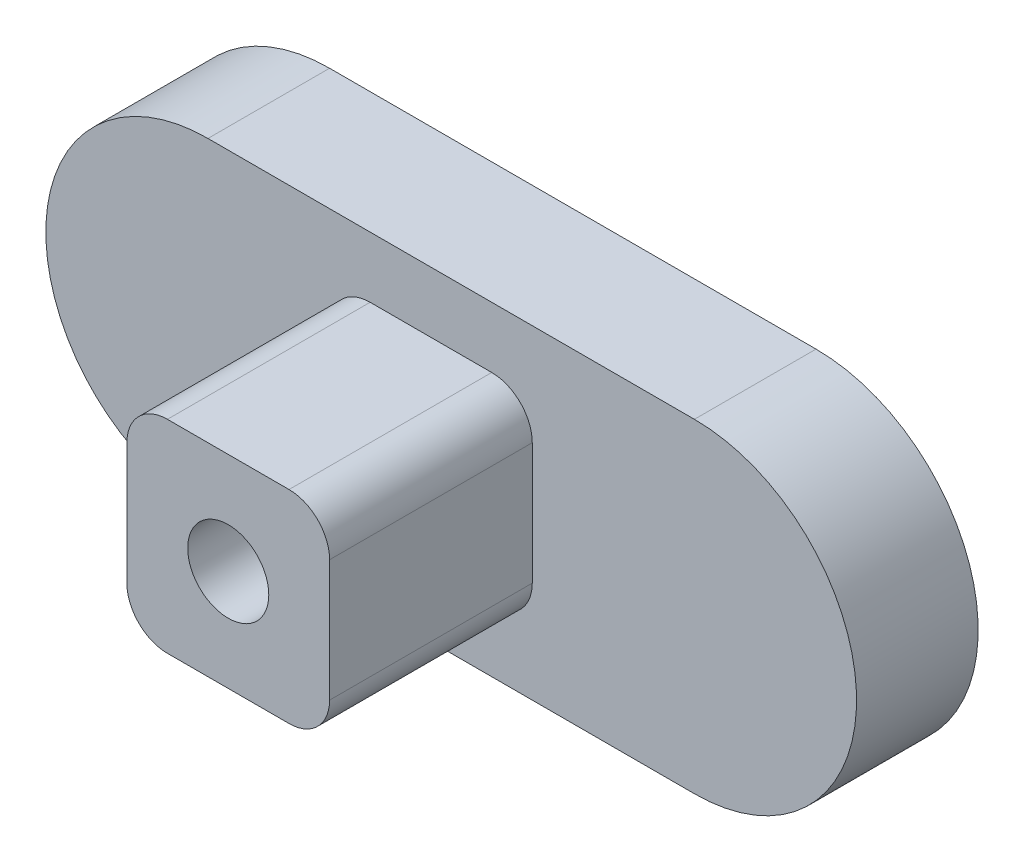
ISO-10303-21;
HEADER;
FILE_DESCRIPTION(('STEP AP214'),'2;1');
FILE_NAME('part.step','',(''),(''),'','','');
FILE_SCHEMA(('AUTOMOTIVE_DESIGN { 1 0 10303 214 1 1 1 1 }'));
ENDSEC;
DATA;
#1=APPLICATION_CONTEXT('core data for automotive mechanical design processes');
#2=APPLICATION_PROTOCOL_DEFINITION('international standard','automotive_design',2000,#1);
#3=PRODUCT_CONTEXT('',#1,'mechanical');
#4=PRODUCT('Part','Part','',(#3));
#5=PRODUCT_RELATED_PRODUCT_CATEGORY('part','',(#4));
#6=PRODUCT_DEFINITION_FORMATION('','',#4);
#7=PRODUCT_DEFINITION_CONTEXT('part definition',#1,'design');
#8=PRODUCT_DEFINITION('design','',#6,#7);
#9=PRODUCT_DEFINITION_SHAPE('','',#8);
#10=(LENGTH_UNIT() NAMED_UNIT(*) SI_UNIT(.MILLI.,.METRE.));
#11=(NAMED_UNIT(*) PLANE_ANGLE_UNIT() SI_UNIT($,.RADIAN.));
#12=(NAMED_UNIT(*) SI_UNIT($,.STERADIAN.) SOLID_ANGLE_UNIT());
#13=UNCERTAINTY_MEASURE_WITH_UNIT(LENGTH_MEASURE(1.E-05),#10,'distance_accuracy_value','');
#14=(GEOMETRIC_REPRESENTATION_CONTEXT(3) GLOBAL_UNCERTAINTY_ASSIGNED_CONTEXT((#13)) GLOBAL_UNIT_ASSIGNED_CONTEXT((#10,
#11,#12)) REPRESENTATION_CONTEXT('',''));
#15=CARTESIAN_POINT('',(0.,0.,0.));
#16=DIRECTION('',(0.,0.,1.));
#17=DIRECTION('',(1.,0.,0.));
#18=AXIS2_PLACEMENT_3D('',#15,#16,#17);
#19=CARTESIAN_POINT('',(-6.,0.,0.));
#20=DIRECTION('',(0.,0.,1.));
#21=DIRECTION('',(1.,0.,0.));
#22=AXIS2_PLACEMENT_3D('',#19,#20,#21);
#23=PLANE('',#22);
#24=CARTESIAN_POINT('',(-2.5,-2.5,0.));
#25=DIRECTION('',(0.,0.,-1.));
#26=DIRECTION('',(-1.,0.,0.));
#27=AXIS2_PLACEMENT_3D('',#24,#25,#26);
#28=CIRCLE('',#27,0.5);
#29=CARTESIAN_POINT('',(-2.,-2.5,0.));
#30=VERTEX_POINT('',#29);
#31=CARTESIAN_POINT('',(-3.,-2.5,0.));
#32=VERTEX_POINT('',#31);
#33=EDGE_CURVE('E277',#30,#32,#28,.T.);
#34=ORIENTED_EDGE('',*,*,#33,.F.);
#35=DIRECTION('',(0.,-1.,0.));
#36=VECTOR('',#35,1.);
#37=CARTESIAN_POINT('',(-2.,-2.5,0.));
#38=LINE('',#37,#36);
#39=CARTESIAN_POINT('',(-2.,2.5,0.));
#40=VERTEX_POINT('',#39);
#41=EDGE_CURVE('E286',#40,#30,#38,.T.);
#42=ORIENTED_EDGE('',*,*,#41,.F.);
#43=CARTESIAN_POINT('',(-2.5,2.5,0.));
#44=DIRECTION('',(0.,0.,-1.));
#45=DIRECTION('',(-1.,0.,0.));
#46=AXIS2_PLACEMENT_3D('',#43,#44,#45);
#47=CIRCLE('',#46,0.5);
#48=CARTESIAN_POINT('',(-3.,2.5,0.));
#49=VERTEX_POINT('',#48);
#50=EDGE_CURVE('E283',#49,#40,#47,.T.);
#51=ORIENTED_EDGE('',*,*,#50,.F.);
#52=DIRECTION('',(0.,1.,0.));
#53=VECTOR('',#52,1.);
#54=CARTESIAN_POINT('',(-3.,-2.5,0.));
#55=LINE('',#54,#53);
#56=EDGE_CURVE('E280',#32,#49,#55,.T.);
#57=ORIENTED_EDGE('',*,*,#56,.F.);
#58=EDGE_LOOP('',(#34,#42,#51,#57));
#59=FACE_BOUND('',#58,.T.);
#60=CARTESIAN_POINT('',(-6.,0.,0.));
#61=DIRECTION('',(0.,0.,1.));
#62=DIRECTION('',(1.,0.,0.));
#63=AXIS2_PLACEMENT_3D('',#60,#61,#62);
#64=CIRCLE('',#63,4.);
#65=CARTESIAN_POINT('',(-6.,4.,0.));
#66=VERTEX_POINT('',#65);
#67=CARTESIAN_POINT('',(-6.,-4.,0.));
#68=VERTEX_POINT('',#67);
#69=EDGE_CURVE('E360',#66,#68,#64,.T.);
#70=ORIENTED_EDGE('',*,*,#69,.F.);
#71=DIRECTION('',(-1.,0.,0.));
#72=VECTOR('',#71,1.);
#73=CARTESIAN_POINT('',(-6.,4.,0.));
#74=LINE('',#73,#72);
#75=CARTESIAN_POINT('',(6.,4.,0.));
#76=VERTEX_POINT('',#75);
#77=EDGE_CURVE('E367',#76,#66,#74,.T.);
#78=ORIENTED_EDGE('',*,*,#77,.F.);
#79=CARTESIAN_POINT('',(6.,0.,0.));
#80=DIRECTION('',(0.,0.,1.));
#81=DIRECTION('',(1.,0.,0.));
#82=AXIS2_PLACEMENT_3D('',#79,#80,#81);
#83=CIRCLE('',#82,4.);
#84=CARTESIAN_POINT('',(6.,-4.,0.));
#85=VERTEX_POINT('',#84);
#86=EDGE_CURVE('E365',#85,#76,#83,.T.);
#87=ORIENTED_EDGE('',*,*,#86,.F.);
#88=DIRECTION('',(1.,0.,0.));
#89=VECTOR('',#88,1.);
#90=CARTESIAN_POINT('',(6.,-4.,0.));
#91=LINE('',#90,#89);
#92=EDGE_CURVE('E363',#68,#85,#91,.T.);
#93=ORIENTED_EDGE('',*,*,#92,.F.);
#94=EDGE_LOOP('',(#70,#78,#87,#93));
#95=FACE_BOUND('',#94,.T.);
#96=CARTESIAN_POINT('',(0.5,-2.5,0.));
#97=DIRECTION('',(0.,0.,-1.));
#98=DIRECTION('',(-1.,0.,0.));
#99=AXIS2_PLACEMENT_3D('',#96,#97,#98);
#100=CIRCLE('',#99,0.5);
#101=CARTESIAN_POINT('',(1.,-2.5,0.));
#102=VERTEX_POINT('',#101);
#103=CARTESIAN_POINT('',(0.,-2.5,0.));
#104=VERTEX_POINT('',#103);
#105=EDGE_CURVE('E262',#102,#104,#100,.T.);
#106=ORIENTED_EDGE('',*,*,#105,.F.);
#107=DIRECTION('',(0.,-1.,0.));
#108=VECTOR('',#107,1.);
#109=CARTESIAN_POINT('',(1.,-2.5,0.));
#110=LINE('',#109,#108);
#111=CARTESIAN_POINT('',(1.,2.5,0.));
#112=VERTEX_POINT('',#111);
#113=EDGE_CURVE('E226',#112,#102,#110,.T.);
#114=ORIENTED_EDGE('',*,*,#113,.F.);
#115=CARTESIAN_POINT('',(0.5,2.5,0.));
#116=DIRECTION('',(0.,0.,-1.));
#117=DIRECTION('',(-1.,0.,0.));
#118=AXIS2_PLACEMENT_3D('',#115,#116,#117);
#119=CIRCLE('',#118,0.5);
#120=CARTESIAN_POINT('',(0.,2.5,0.));
#121=VERTEX_POINT('',#120);
#122=EDGE_CURVE('E249',#121,#112,#119,.T.);
#123=ORIENTED_EDGE('',*,*,#122,.F.);
#124=DIRECTION('',(0.,1.,0.));
#125=VECTOR('',#124,1.);
#126=CARTESIAN_POINT('',(0.,-2.5,0.));
#127=LINE('',#126,#125);
#128=EDGE_CURVE('E259',#104,#121,#127,.T.);
#129=ORIENTED_EDGE('',*,*,#128,.F.);
#130=EDGE_LOOP('',(#106,#114,#123,#129));
#131=FACE_BOUND('',#130,.T.);
#132=CARTESIAN_POINT('',(3.5,-2.5,0.));
#133=DIRECTION('',(0.,0.,-1.));
#134=DIRECTION('',(-1.,0.,0.));
#135=AXIS2_PLACEMENT_3D('',#132,#133,#134);
#136=CIRCLE('',#135,0.5);
#137=CARTESIAN_POINT('',(4.,-2.5,0.));
#138=VERTEX_POINT('',#137);
#139=CARTESIAN_POINT('',(3.,-2.5,0.));
#140=VERTEX_POINT('',#139);
#141=EDGE_CURVE('E399',#138,#140,#136,.T.);
#142=ORIENTED_EDGE('',*,*,#141,.F.);
#143=DIRECTION('',(0.,-1.,0.));
#144=VECTOR('',#143,1.);
#145=CARTESIAN_POINT('',(4.,-2.5,0.));
#146=LINE('',#145,#144);
#147=CARTESIAN_POINT('',(4.,2.5,0.));
#148=VERTEX_POINT('',#147);
#149=EDGE_CURVE('E401',#148,#138,#146,.T.);
#150=ORIENTED_EDGE('',*,*,#149,.F.);
#151=CARTESIAN_POINT('',(3.5,2.5,0.));
#152=DIRECTION('',(0.,0.,-1.));
#153=DIRECTION('',(-1.,0.,0.));
#154=AXIS2_PLACEMENT_3D('',#151,#152,#153);
#155=CIRCLE('',#154,0.5);
#156=CARTESIAN_POINT('',(3.,2.5,0.));
#157=VERTEX_POINT('',#156);
#158=EDGE_CURVE('E404',#157,#148,#155,.T.);
#159=ORIENTED_EDGE('',*,*,#158,.F.);
#160=DIRECTION('',(0.,1.,0.));
#161=VECTOR('',#160,1.);
#162=CARTESIAN_POINT('',(3.,-2.5,0.));
#163=LINE('',#162,#161);
#164=EDGE_CURVE('E407',#140,#157,#163,.T.);
#165=ORIENTED_EDGE('',*,*,#164,.F.);
#166=EDGE_LOOP('',(#142,#150,#159,#165));
#167=FACE_BOUND('',#166,.T.);
#168=ADVANCED_FACE('F34',(#59,#95,#131,#167),#23,.F.);
#169=CARTESIAN_POINT('',(-6.,0.,3.));
#170=DIRECTION('',(0.,0.,1.));
#171=DIRECTION('',(1.,0.,0.));
#172=AXIS2_PLACEMENT_3D('',#169,#170,#171);
#173=PLANE('',#172);
#174=CARTESIAN_POINT('',(-6.,0.,3.));
#175=DIRECTION('',(0.,0.,1.));
#176=DIRECTION('',(1.,0.,0.));
#177=AXIS2_PLACEMENT_3D('',#174,#175,#176);
#178=CIRCLE('',#177,4.);
#179=CARTESIAN_POINT('',(-6.,4.,3.));
#180=VERTEX_POINT('',#179);
#181=CARTESIAN_POINT('',(-6.,-4.,3.));
#182=VERTEX_POINT('',#181);
#183=EDGE_CURVE('E369',#180,#182,#178,.T.);
#184=ORIENTED_EDGE('',*,*,#183,.T.);
#185=DIRECTION('',(1.,0.,0.));
#186=VECTOR('',#185,1.);
#187=CARTESIAN_POINT('',(6.,-4.,3.));
#188=LINE('',#187,#186);
#189=CARTESIAN_POINT('',(6.,-4.,3.));
#190=VERTEX_POINT('',#189);
#191=EDGE_CURVE('E372',#182,#190,#188,.T.);
#192=ORIENTED_EDGE('',*,*,#191,.T.);
#193=CARTESIAN_POINT('',(6.,0.,3.));
#194=DIRECTION('',(0.,0.,1.));
#195=DIRECTION('',(1.,0.,0.));
#196=AXIS2_PLACEMENT_3D('',#193,#194,#195);
#197=CIRCLE('',#196,4.);
#198=CARTESIAN_POINT('',(6.,4.,3.));
#199=VERTEX_POINT('',#198);
#200=EDGE_CURVE('E374',#190,#199,#197,.T.);
#201=ORIENTED_EDGE('',*,*,#200,.T.);
#202=DIRECTION('',(-1.,0.,0.));
#203=VECTOR('',#202,1.);
#204=CARTESIAN_POINT('',(-6.,4.,3.));
#205=LINE('',#204,#203);
#206=EDGE_CURVE('E376',#199,#180,#205,.T.);
#207=ORIENTED_EDGE('',*,*,#206,.T.);
#208=EDGE_LOOP('',(#184,#192,#201,#207));
#209=FACE_BOUND('',#208,.T.);
#210=DIRECTION('',(-1.,0.,0.));
#211=VECTOR('',#210,1.);
#212=CARTESIAN_POINT('',(-1.99999999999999,2.5,3.));
#213=LINE('',#212,#211);
#214=CARTESIAN_POINT('',(0.999999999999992,2.5,3.));
#215=VERTEX_POINT('',#214);
#216=CARTESIAN_POINT('',(-1.99999999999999,2.5,3.));
#217=VERTEX_POINT('',#216);
#218=EDGE_CURVE('E306',#215,#217,#213,.T.);
#219=ORIENTED_EDGE('',*,*,#218,.F.);
#220=CARTESIAN_POINT('',(0.999999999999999,1.5,3.));
#221=DIRECTION('',(0.,0.,1.));
#222=DIRECTION('',(-1.,0.,0.));
#223=AXIS2_PLACEMENT_3D('',#220,#221,#222);
#224=CIRCLE('',#223,1.);
#225=CARTESIAN_POINT('',(2.,1.49999999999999,3.));
#226=VERTEX_POINT('',#225);
#227=EDGE_CURVE('E303',#226,#215,#224,.T.);
#228=ORIENTED_EDGE('',*,*,#227,.F.);
#229=DIRECTION('',(0.,1.,0.));
#230=VECTOR('',#229,1.);
#231=CARTESIAN_POINT('',(2.,1.49999999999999,3.));
#232=LINE('',#231,#230);
#233=CARTESIAN_POINT('',(2.,-1.49999999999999,3.));
#234=VERTEX_POINT('',#233);
#235=EDGE_CURVE('E319',#234,#226,#232,.T.);
#236=ORIENTED_EDGE('',*,*,#235,.F.);
#237=CARTESIAN_POINT('',(1.,-1.5,3.));
#238=DIRECTION('',(0.,0.,1.));
#239=DIRECTION('',(1.,0.,0.));
#240=AXIS2_PLACEMENT_3D('',#237,#238,#239);
#241=CIRCLE('',#240,1.);
#242=CARTESIAN_POINT('',(0.999999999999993,-2.5,3.));
#243=VERTEX_POINT('',#242);
#244=EDGE_CURVE('E316',#243,#234,#241,.T.);
#245=ORIENTED_EDGE('',*,*,#244,.F.);
#246=DIRECTION('',(1.,0.,0.));
#247=VECTOR('',#246,1.);
#248=CARTESIAN_POINT('',(-1.99999999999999,-2.5,3.));
#249=LINE('',#248,#247);
#250=CARTESIAN_POINT('',(-1.99999999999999,-2.5,3.));
#251=VERTEX_POINT('',#250);
#252=EDGE_CURVE('E314',#251,#243,#249,.T.);
#253=ORIENTED_EDGE('',*,*,#252,.F.);
#254=CARTESIAN_POINT('',(-2.,-1.5,3.));
#255=DIRECTION('',(0.,0.,1.));
#256=DIRECTION('',(1.,0.,0.));
#257=AXIS2_PLACEMENT_3D('',#254,#255,#256);
#258=CIRCLE('',#257,1.);
#259=CARTESIAN_POINT('',(-3.,-1.49999999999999,3.));
#260=VERTEX_POINT('',#259);
#261=EDGE_CURVE('E312',#260,#251,#258,.T.);
#262=ORIENTED_EDGE('',*,*,#261,.F.);
#263=DIRECTION('',(0.,-1.,0.));
#264=VECTOR('',#263,1.);
#265=CARTESIAN_POINT('',(-3.,1.49999999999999,3.));
#266=LINE('',#265,#264);
#267=CARTESIAN_POINT('',(-3.,1.49999999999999,3.));
#268=VERTEX_POINT('',#267);
#269=EDGE_CURVE('E310',#268,#260,#266,.T.);
#270=ORIENTED_EDGE('',*,*,#269,.F.);
#271=CARTESIAN_POINT('',(-2.,1.5,3.));
#272=DIRECTION('',(0.,0.,1.));
#273=DIRECTION('',(1.,0.,0.));
#274=AXIS2_PLACEMENT_3D('',#271,#272,#273);
#275=CIRCLE('',#274,1.);
#276=EDGE_CURVE('E308',#217,#268,#275,.T.);
#277=ORIENTED_EDGE('',*,*,#276,.F.);
#278=EDGE_LOOP('',(#219,#228,#236,#245,#253,#262,#270,#277));
#279=FACE_BOUND('',#278,.T.);
#280=ADVANCED_FACE('F459',(#209,#279),#173,.T.);
#281=CARTESIAN_POINT('',(-6.,0.,3.));
#282=DIRECTION('',(0.,0.,-1.));
#283=DIRECTION('',(-1.,0.,0.));
#284=AXIS2_PLACEMENT_3D('',#281,#282,#283);
#285=CYLINDRICAL_SURFACE('',#284,4.);
#286=ORIENTED_EDGE('',*,*,#69,.T.);
#287=DIRECTION('',(0.,0.,-1.));
#288=VECTOR('',#287,1.);
#289=CARTESIAN_POINT('',(-6.,-4.,3.));
#290=LINE('',#289,#288);
#291=EDGE_CURVE('E387',#182,#68,#290,.T.);
#292=ORIENTED_EDGE('',*,*,#291,.F.);
#293=ORIENTED_EDGE('',*,*,#183,.F.);
#294=DIRECTION('',(0.,0.,-1.));
#295=VECTOR('',#294,1.);
#296=CARTESIAN_POINT('',(-6.,4.,3.));
#297=LINE('',#296,#295);
#298=EDGE_CURVE('E378',#180,#66,#297,.T.);
#299=ORIENTED_EDGE('',*,*,#298,.T.);
#300=EDGE_LOOP('',(#286,#292,#293,#299));
#301=FACE_BOUND('',#300,.T.);
#302=ADVANCED_FACE('F465',(#301),#285,.T.);
#303=CARTESIAN_POINT('',(6.,-4.,3.));
#304=DIRECTION('',(0.,1.,0.));
#305=DIRECTION('',(-1.,0.,0.));
#306=AXIS2_PLACEMENT_3D('',#303,#304,#305);
#307=PLANE('',#306);
#308=ORIENTED_EDGE('',*,*,#92,.T.);
#309=DIRECTION('',(0.,0.,-1.));
#310=VECTOR('',#309,1.);
#311=CARTESIAN_POINT('',(6.,-4.,3.));
#312=LINE('',#311,#310);
#313=EDGE_CURVE('E384',#190,#85,#312,.T.);
#314=ORIENTED_EDGE('',*,*,#313,.F.);
#315=ORIENTED_EDGE('',*,*,#191,.F.);
#316=ORIENTED_EDGE('',*,*,#291,.T.);
#317=EDGE_LOOP('',(#308,#314,#315,#316));
#318=FACE_BOUND('',#317,.T.);
#319=ADVANCED_FACE('F481',(#318),#307,.F.);
#320=CARTESIAN_POINT('',(6.,0.,3.));
#321=DIRECTION('',(0.,0.,-1.));
#322=DIRECTION('',(-1.,0.,0.));
#323=AXIS2_PLACEMENT_3D('',#320,#321,#322);
#324=CYLINDRICAL_SURFACE('',#323,4.);
#325=ORIENTED_EDGE('',*,*,#86,.T.);
#326=DIRECTION('',(0.,0.,-1.));
#327=VECTOR('',#326,1.);
#328=CARTESIAN_POINT('',(6.,4.,3.));
#329=LINE('',#328,#327);
#330=EDGE_CURVE('E381',#199,#76,#329,.T.);
#331=ORIENTED_EDGE('',*,*,#330,.F.);
#332=ORIENTED_EDGE('',*,*,#200,.F.);
#333=ORIENTED_EDGE('',*,*,#313,.T.);
#334=EDGE_LOOP('',(#325,#331,#332,#333));
#335=FACE_BOUND('',#334,.T.);
#336=ADVANCED_FACE('F477',(#335),#324,.T.);
#337=CARTESIAN_POINT('',(-6.,4.,3.));
#338=DIRECTION('',(0.,-1.,0.));
#339=DIRECTION('',(1.,0.,0.));
#340=AXIS2_PLACEMENT_3D('',#337,#338,#339);
#341=PLANE('',#340);
#342=ORIENTED_EDGE('',*,*,#77,.T.);
#343=ORIENTED_EDGE('',*,*,#298,.F.);
#344=ORIENTED_EDGE('',*,*,#206,.F.);
#345=ORIENTED_EDGE('',*,*,#330,.T.);
#346=EDGE_LOOP('',(#342,#343,#344,#345));
#347=FACE_BOUND('',#346,.T.);
#348=ADVANCED_FACE('F474',(#347),#341,.F.);
#349=CARTESIAN_POINT('',(0.999999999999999,1.5,8.));
#350=DIRECTION('',(0.,0.,-1.));
#351=DIRECTION('',(-1.,0.,0.));
#352=AXIS2_PLACEMENT_3D('',#349,#350,#351);
#353=CYLINDRICAL_SURFACE('',#352,1.);
#354=ORIENTED_EDGE('',*,*,#227,.T.);
#355=DIRECTION('',(0.,0.,-1.));
#356=VECTOR('',#355,1.);
#357=CARTESIAN_POINT('',(0.999999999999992,2.5,8.));
#358=LINE('',#357,#356);
#359=CARTESIAN_POINT('',(0.999999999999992,2.5,8.));
#360=VERTEX_POINT('',#359);
#361=EDGE_CURVE('E358',#360,#215,#358,.T.);
#362=ORIENTED_EDGE('',*,*,#361,.F.);
#363=CARTESIAN_POINT('',(0.999999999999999,1.5,8.));
#364=DIRECTION('',(0.,0.,1.));
#365=DIRECTION('',(-1.,0.,0.));
#366=AXIS2_PLACEMENT_3D('',#363,#364,#365);
#367=CIRCLE('',#366,1.);
#368=CARTESIAN_POINT('',(2.,1.49999999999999,8.));
#369=VERTEX_POINT('',#368);
#370=EDGE_CURVE('E321',#369,#360,#367,.T.);
#371=ORIENTED_EDGE('',*,*,#370,.F.);
#372=DIRECTION('',(0.,0.,-1.));
#373=VECTOR('',#372,1.);
#374=CARTESIAN_POINT('',(2.,1.49999999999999,8.));
#375=LINE('',#374,#373);
#376=EDGE_CURVE('E338',#369,#226,#375,.T.);
#377=ORIENTED_EDGE('',*,*,#376,.T.);
#378=EDGE_LOOP('',(#354,#362,#371,#377));
#379=FACE_BOUND('',#378,.T.);
#380=ADVANCED_FACE('F471',(#379),#353,.T.);
#381=CARTESIAN_POINT('',(-1.99999999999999,2.5,8.));
#382=DIRECTION('',(0.,-1.,0.));
#383=DIRECTION('',(1.,0.,0.));
#384=AXIS2_PLACEMENT_3D('',#381,#382,#383);
#385=PLANE('',#384);
#386=ORIENTED_EDGE('',*,*,#218,.T.);
#387=DIRECTION('',(0.,0.,-1.));
#388=VECTOR('',#387,1.);
#389=CARTESIAN_POINT('',(-1.99999999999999,2.5,8.));
#390=LINE('',#389,#388);
#391=CARTESIAN_POINT('',(-1.99999999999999,2.5,8.));
#392=VERTEX_POINT('',#391);
#393=EDGE_CURVE('E355',#392,#217,#390,.T.);
#394=ORIENTED_EDGE('',*,*,#393,.F.);
#395=DIRECTION('',(-1.,0.,0.));
#396=VECTOR('',#395,1.);
#397=CARTESIAN_POINT('',(-1.99999999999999,2.5,8.));
#398=LINE('',#397,#396);
#399=EDGE_CURVE('E324',#360,#392,#398,.T.);
#400=ORIENTED_EDGE('',*,*,#399,.F.);
#401=ORIENTED_EDGE('',*,*,#361,.T.);
#402=EDGE_LOOP('',(#386,#394,#400,#401));
#403=FACE_BOUND('',#402,.T.);
#404=ADVANCED_FACE('F761',(#403),#385,.F.);
#405=CARTESIAN_POINT('',(-2.,1.5,8.));
#406=DIRECTION('',(0.,0.,-1.));
#407=DIRECTION('',(-1.,0.,0.));
#408=AXIS2_PLACEMENT_3D('',#405,#406,#407);
#409=CYLINDRICAL_SURFACE('',#408,1.);
#410=ORIENTED_EDGE('',*,*,#276,.T.);
#411=DIRECTION('',(0.,0.,-1.));
#412=VECTOR('',#411,1.);
#413=CARTESIAN_POINT('',(-3.,1.49999999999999,8.));
#414=LINE('',#413,#412);
#415=CARTESIAN_POINT('',(-3.,1.49999999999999,8.));
#416=VERTEX_POINT('',#415);
#417=EDGE_CURVE('E352',#416,#268,#414,.T.);
#418=ORIENTED_EDGE('',*,*,#417,.F.);
#419=CARTESIAN_POINT('',(-2.,1.5,8.));
#420=DIRECTION('',(0.,0.,1.));
#421=DIRECTION('',(1.,0.,0.));
#422=AXIS2_PLACEMENT_3D('',#419,#420,#421);
#423=CIRCLE('',#422,1.);
#424=EDGE_CURVE('E326',#392,#416,#423,.T.);
#425=ORIENTED_EDGE('',*,*,#424,.F.);
#426=ORIENTED_EDGE('',*,*,#393,.T.);
#427=EDGE_LOOP('',(#410,#418,#425,#426));
#428=FACE_BOUND('',#427,.T.);
#429=ADVANCED_FACE('F752',(#428),#409,.T.);
#430=CARTESIAN_POINT('',(-3.,1.49999999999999,8.));
#431=DIRECTION('',(1.,0.,0.));
#432=DIRECTION('',(0.,0.,-1.));
#433=AXIS2_PLACEMENT_3D('',#430,#431,#432);
#434=PLANE('',#433);
#435=ORIENTED_EDGE('',*,*,#269,.T.);
#436=DIRECTION('',(0.,0.,-1.));
#437=VECTOR('',#436,1.);
#438=CARTESIAN_POINT('',(-3.,-1.49999999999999,8.));
#439=LINE('',#438,#437);
#440=CARTESIAN_POINT('',(-3.,-1.49999999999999,8.));
#441=VERTEX_POINT('',#440);
#442=EDGE_CURVE('E349',#441,#260,#439,.T.);
#443=ORIENTED_EDGE('',*,*,#442,.F.);
#444=DIRECTION('',(0.,-1.,0.));
#445=VECTOR('',#444,1.);
#446=CARTESIAN_POINT('',(-3.,1.49999999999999,8.));
#447=LINE('',#446,#445);
#448=EDGE_CURVE('E328',#416,#441,#447,.T.);
#449=ORIENTED_EDGE('',*,*,#448,.F.);
#450=ORIENTED_EDGE('',*,*,#417,.T.);
#451=EDGE_LOOP('',(#435,#443,#449,#450));
#452=FACE_BOUND('',#451,.T.);
#453=ADVANCED_FACE('F743',(#452),#434,.F.);
#454=CARTESIAN_POINT('',(-2.,-1.5,8.));
#455=DIRECTION('',(0.,0.,-1.));
#456=DIRECTION('',(-1.,0.,0.));
#457=AXIS2_PLACEMENT_3D('',#454,#455,#456);
#458=CYLINDRICAL_SURFACE('',#457,1.);
#459=ORIENTED_EDGE('',*,*,#261,.T.);
#460=DIRECTION('',(0.,0.,-1.));
#461=VECTOR('',#460,1.);
#462=CARTESIAN_POINT('',(-1.99999999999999,-2.5,8.));
#463=LINE('',#462,#461);
#464=CARTESIAN_POINT('',(-1.99999999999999,-2.5,8.));
#465=VERTEX_POINT('',#464);
#466=EDGE_CURVE('E346',#465,#251,#463,.T.);
#467=ORIENTED_EDGE('',*,*,#466,.F.);
#468=CARTESIAN_POINT('',(-2.,-1.5,8.));
#469=DIRECTION('',(0.,0.,1.));
#470=DIRECTION('',(1.,0.,0.));
#471=AXIS2_PLACEMENT_3D('',#468,#469,#470);
#472=CIRCLE('',#471,1.);
#473=EDGE_CURVE('E330',#441,#465,#472,.T.);
#474=ORIENTED_EDGE('',*,*,#473,.F.);
#475=ORIENTED_EDGE('',*,*,#442,.T.);
#476=EDGE_LOOP('',(#459,#467,#474,#475));
#477=FACE_BOUND('',#476,.T.);
#478=ADVANCED_FACE('F734',(#477),#458,.T.);
#479=CARTESIAN_POINT('',(-1.99999999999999,-2.5,8.));
#480=DIRECTION('',(0.,1.,0.));
#481=DIRECTION('',(0.,0.,1.));
#482=AXIS2_PLACEMENT_3D('',#479,#480,#481);
#483=PLANE('',#482);
#484=ORIENTED_EDGE('',*,*,#252,.T.);
#485=DIRECTION('',(0.,0.,-1.));
#486=VECTOR('',#485,1.);
#487=CARTESIAN_POINT('',(0.999999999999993,-2.5,8.));
#488=LINE('',#487,#486);
#489=CARTESIAN_POINT('',(0.999999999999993,-2.5,8.));
#490=VERTEX_POINT('',#489);
#491=EDGE_CURVE('E343',#490,#243,#488,.T.);
#492=ORIENTED_EDGE('',*,*,#491,.F.);
#493=DIRECTION('',(1.,0.,0.));
#494=VECTOR('',#493,1.);
#495=CARTESIAN_POINT('',(-1.99999999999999,-2.5,8.));
#496=LINE('',#495,#494);
#497=EDGE_CURVE('E332',#465,#490,#496,.T.);
#498=ORIENTED_EDGE('',*,*,#497,.F.);
#499=ORIENTED_EDGE('',*,*,#466,.T.);
#500=EDGE_LOOP('',(#484,#492,#498,#499));
#501=FACE_BOUND('',#500,.T.);
#502=ADVANCED_FACE('F725',(#501),#483,.F.);
#503=CARTESIAN_POINT('',(1.,-1.5,8.));
#504=DIRECTION('',(0.,0.,-1.));
#505=DIRECTION('',(-1.,0.,0.));
#506=AXIS2_PLACEMENT_3D('',#503,#504,#505);
#507=CYLINDRICAL_SURFACE('',#506,1.);
#508=ORIENTED_EDGE('',*,*,#244,.T.);
#509=DIRECTION('',(0.,0.,-1.));
#510=VECTOR('',#509,1.);
#511=CARTESIAN_POINT('',(2.,-1.49999999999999,8.));
#512=LINE('',#511,#510);
#513=CARTESIAN_POINT('',(2.,-1.49999999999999,8.));
#514=VERTEX_POINT('',#513);
#515=EDGE_CURVE('E341',#514,#234,#512,.T.);
#516=ORIENTED_EDGE('',*,*,#515,.F.);
#517=CARTESIAN_POINT('',(1.,-1.5,8.));
#518=DIRECTION('',(0.,0.,1.));
#519=DIRECTION('',(1.,0.,0.));
#520=AXIS2_PLACEMENT_3D('',#517,#518,#519);
#521=CIRCLE('',#520,1.);
#522=EDGE_CURVE('E334',#490,#514,#521,.T.);
#523=ORIENTED_EDGE('',*,*,#522,.F.);
#524=ORIENTED_EDGE('',*,*,#491,.T.);
#525=EDGE_LOOP('',(#508,#516,#523,#524));
#526=FACE_BOUND('',#525,.T.);
#527=ADVANCED_FACE('F716',(#526),#507,.T.);
#528=CARTESIAN_POINT('',(2.,1.49999999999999,8.));
#529=DIRECTION('',(-1.,0.,0.));
#530=DIRECTION('',(0.,-1.,0.));
#531=AXIS2_PLACEMENT_3D('',#528,#529,#530);
#532=PLANE('',#531);
#533=ORIENTED_EDGE('',*,*,#235,.T.);
#534=ORIENTED_EDGE('',*,*,#376,.F.);
#535=DIRECTION('',(0.,1.,0.));
#536=VECTOR('',#535,1.);
#537=CARTESIAN_POINT('',(2.,1.49999999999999,8.));
#538=LINE('',#537,#536);
#539=EDGE_CURVE('E336',#514,#369,#538,.T.);
#540=ORIENTED_EDGE('',*,*,#539,.F.);
#541=ORIENTED_EDGE('',*,*,#515,.T.);
#542=EDGE_LOOP('',(#533,#534,#540,#541));
#543=FACE_BOUND('',#542,.T.);
#544=ADVANCED_FACE('F707',(#543),#532,.F.);
#545=CARTESIAN_POINT('',(0.999999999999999,1.5,8.));
#546=DIRECTION('',(0.,0.,-1.));
#547=DIRECTION('',(-1.,0.,0.));
#548=AXIS2_PLACEMENT_3D('',#545,#546,#547);
#549=PLANE('',#548);
#550=CARTESIAN_POINT('',(-0.5,0.,8.));
#551=DIRECTION('',(0.,0.,1.));
#552=DIRECTION('',(1.,0.,0.));
#553=AXIS2_PLACEMENT_3D('',#550,#551,#552);
#554=CIRCLE('',#553,1.);
#555=CARTESIAN_POINT('',(0.5,0.,8.));
#556=VERTEX_POINT('',#555);
#557=EDGE_CURVE('E297',#556,#556,#554,.T.);
#558=ORIENTED_EDGE('',*,*,#557,.F.);
#559=EDGE_LOOP('',(#558));
#560=FACE_BOUND('',#559,.T.);
#561=ORIENTED_EDGE('',*,*,#370,.T.);
#562=ORIENTED_EDGE('',*,*,#399,.T.);
#563=ORIENTED_EDGE('',*,*,#424,.T.);
#564=ORIENTED_EDGE('',*,*,#448,.T.);
#565=ORIENTED_EDGE('',*,*,#473,.T.);
#566=ORIENTED_EDGE('',*,*,#497,.T.);
#567=ORIENTED_EDGE('',*,*,#522,.T.);
#568=ORIENTED_EDGE('',*,*,#539,.T.);
#569=EDGE_LOOP('',(#561,#562,#563,#564,#565,#566,#567,#568));
#570=FACE_BOUND('',#569,.T.);
#571=ADVANCED_FACE('F698',(#560,#570),#549,.F.);
#572=CARTESIAN_POINT('',(-0.5,0.,1.));
#573=DIRECTION('',(0.,0.,1.));
#574=DIRECTION('',(1.,0.,0.));
#575=AXIS2_PLACEMENT_3D('',#572,#573,#574);
#576=CYLINDRICAL_SURFACE('',#575,1.);
#577=CARTESIAN_POINT('',(-0.5,0.,1.));
#578=DIRECTION('',(0.,0.,1.));
#579=DIRECTION('',(1.,0.,0.));
#580=AXIS2_PLACEMENT_3D('',#577,#578,#579);
#581=CIRCLE('',#580,1.);
#582=CARTESIAN_POINT('',(0.5,0.,1.));
#583=VERTEX_POINT('',#582);
#584=EDGE_CURVE('E300',#583,#583,#581,.T.);
#585=ORIENTED_EDGE('',*,*,#584,.F.);
#586=EDGE_LOOP('',(#585));
#587=FACE_BOUND('',#586,.T.);
#588=ORIENTED_EDGE('',*,*,#557,.T.);
#589=EDGE_LOOP('',(#588));
#590=FACE_BOUND('',#589,.T.);
#591=ADVANCED_FACE('F689',(#587,#590),#576,.F.);
#592=CARTESIAN_POINT('',(-0.5,0.,1.));
#593=DIRECTION('',(0.,0.,1.));
#594=DIRECTION('',(1.,0.,0.));
#595=AXIS2_PLACEMENT_3D('',#592,#593,#594);
#596=PLANE('',#595);
#597=ORIENTED_EDGE('',*,*,#584,.T.);
#598=EDGE_LOOP('',(#597));
#599=FACE_BOUND('',#598,.T.);
#600=ADVANCED_FACE('F680',(#599),#596,.T.);
#601=CARTESIAN_POINT('',(-2.5,-2.5,-1.));
#602=DIRECTION('',(0.,0.,1.));
#603=DIRECTION('',(1.,0.,0.));
#604=AXIS2_PLACEMENT_3D('',#601,#602,#603);
#605=CYLINDRICAL_SURFACE('',#604,0.5);
#606=DIRECTION('',(0.,0.,1.));
#607=VECTOR('',#606,1.);
#608=CARTESIAN_POINT('',(-3.,-2.5,-1.));
#609=LINE('',#608,#607);
#610=CARTESIAN_POINT('',(-3.,-2.5,-0.5));
#611=VERTEX_POINT('',#610);
#612=EDGE_CURVE('E295',#611,#32,#609,.T.);
#613=ORIENTED_EDGE('',*,*,#612,.F.);
#614=CARTESIAN_POINT('',(-2.5,-2.5,-0.5));
#615=DIRECTION('',(0.,0.,1.));
#616=DIRECTION('',(1.,0.,0.));
#617=AXIS2_PLACEMENT_3D('',#614,#615,#616);
#618=CIRCLE('',#617,0.5);
#619=CARTESIAN_POINT('',(-2.,-2.5,-0.5));
#620=VERTEX_POINT('',#619);
#621=EDGE_CURVE('E397',#611,#620,#618,.T.);
#622=ORIENTED_EDGE('',*,*,#621,.T.);
#623=DIRECTION('',(0.,0.,1.));
#624=VECTOR('',#623,1.);
#625=CARTESIAN_POINT('',(-2.,-2.5,-1.));
#626=LINE('',#625,#624);
#627=EDGE_CURVE('E289',#620,#30,#626,.T.);
#628=ORIENTED_EDGE('',*,*,#627,.T.);
#629=ORIENTED_EDGE('',*,*,#33,.T.);
#630=EDGE_LOOP('',(#613,#622,#628,#629));
#631=FACE_BOUND('',#630,.T.);
#632=ADVANCED_FACE('F671',(#631),#605,.T.);
#633=CARTESIAN_POINT('',(-3.,-2.5,-1.));
#634=DIRECTION('',(1.,0.,0.));
#635=DIRECTION('',(0.,0.,-1.));
#636=AXIS2_PLACEMENT_3D('',#633,#634,#635);
#637=PLANE('',#636);
#638=DIRECTION('',(0.,0.,1.));
#639=VECTOR('',#638,1.);
#640=CARTESIAN_POINT('',(-3.,2.5,-1.));
#641=LINE('',#640,#639);
#642=CARTESIAN_POINT('',(-3.,2.5,-0.5));
#643=VERTEX_POINT('',#642);
#644=EDGE_CURVE('E293',#643,#49,#641,.T.);
#645=ORIENTED_EDGE('',*,*,#644,.F.);
#646=DIRECTION('',(0.,1.,0.));
#647=VECTOR('',#646,1.);
#648=CARTESIAN_POINT('',(-3.,-2.5,-0.5));
#649=LINE('',#648,#647);
#650=EDGE_CURVE('E395',#643,#611,#649,.F.);
#651=ORIENTED_EDGE('',*,*,#650,.T.);
#652=ORIENTED_EDGE('',*,*,#612,.T.);
#653=ORIENTED_EDGE('',*,*,#56,.T.);
#654=EDGE_LOOP('',(#645,#651,#652,#653));
#655=FACE_BOUND('',#654,.T.);
#656=ADVANCED_FACE('F662',(#655),#637,.F.);
#657=CARTESIAN_POINT('',(-2.5,2.5,-1.));
#658=DIRECTION('',(0.,0.,1.));
#659=DIRECTION('',(1.,0.,0.));
#660=AXIS2_PLACEMENT_3D('',#657,#658,#659);
#661=CYLINDRICAL_SURFACE('',#660,0.5);
#662=DIRECTION('',(0.,0.,1.));
#663=VECTOR('',#662,1.);
#664=CARTESIAN_POINT('',(-2.,2.5,-1.));
#665=LINE('',#664,#663);
#666=CARTESIAN_POINT('',(-2.,2.5,-0.5));
#667=VERTEX_POINT('',#666);
#668=EDGE_CURVE('E291',#667,#40,#665,.T.);
#669=ORIENTED_EDGE('',*,*,#668,.F.);
#670=CARTESIAN_POINT('',(-2.5,2.5,-0.5));
#671=DIRECTION('',(0.,0.,1.));
#672=DIRECTION('',(1.,0.,0.));
#673=AXIS2_PLACEMENT_3D('',#670,#671,#672);
#674=CIRCLE('',#673,0.5);
#675=EDGE_CURVE('E393',#667,#643,#674,.T.);
#676=ORIENTED_EDGE('',*,*,#675,.T.);
#677=ORIENTED_EDGE('',*,*,#644,.T.);
#678=ORIENTED_EDGE('',*,*,#50,.T.);
#679=EDGE_LOOP('',(#669,#676,#677,#678));
#680=FACE_BOUND('',#679,.T.);
#681=ADVANCED_FACE('F653',(#680),#661,.T.);
#682=CARTESIAN_POINT('',(-2.,-2.5,-1.));
#683=DIRECTION('',(-1.,0.,0.));
#684=DIRECTION('',(0.,-1.,0.));
#685=AXIS2_PLACEMENT_3D('',#682,#683,#684);
#686=PLANE('',#685);
#687=ORIENTED_EDGE('',*,*,#627,.F.);
#688=DIRECTION('',(0.,-1.,0.));
#689=VECTOR('',#688,1.);
#690=CARTESIAN_POINT('',(-2.,2.5,-0.5));
#691=LINE('',#690,#689);
#692=EDGE_CURVE('E390',#620,#667,#691,.F.);
#693=ORIENTED_EDGE('',*,*,#692,.T.);
#694=ORIENTED_EDGE('',*,*,#668,.T.);
#695=ORIENTED_EDGE('',*,*,#41,.T.);
#696=EDGE_LOOP('',(#687,#693,#694,#695));
#697=FACE_BOUND('',#696,.T.);
#698=ADVANCED_FACE('F644',(#697),#686,.F.);
#699=CARTESIAN_POINT('',(-2.5,2.5,-0.5));
#700=DIRECTION('',(0.,0.,1.));
#701=DIRECTION('',(1.,0.,0.));
#702=AXIS2_PLACEMENT_3D('',#699,#700,#701);
#703=SPHERICAL_SURFACE('',#702,0.5);
#704=CARTESIAN_POINT('',(-2.5,2.5,-0.5));
#705=DIRECTION('',(0.,-1.,0.));
#706=DIRECTION('',(0.,0.,-1.));
#707=AXIS2_PLACEMENT_3D('',#704,#705,#706);
#708=CIRCLE('',#707,0.5);
#709=CARTESIAN_POINT('',(-2.5,2.5,-1.));
#710=VERTEX_POINT('',#709);
#711=EDGE_CURVE('E275',#643,#710,#708,.T.);
#712=ORIENTED_EDGE('',*,*,#711,.F.);
#713=ORIENTED_EDGE('',*,*,#675,.F.);
#714=CARTESIAN_POINT('',(-2.5,2.5,-0.5));
#715=DIRECTION('',(0.,-1.,0.));
#716=DIRECTION('',(0.,0.,-1.));
#717=AXIS2_PLACEMENT_3D('',#714,#715,#716);
#718=CIRCLE('',#717,0.5);
#719=EDGE_CURVE('E271',#710,#667,#718,.T.);
#720=ORIENTED_EDGE('',*,*,#719,.F.);
#721=EDGE_LOOP('',(#712,#713,#720));
#722=FACE_BOUND('',#721,.T.);
#723=ADVANCED_FACE('F635',(#722),#703,.T.);
#724=CARTESIAN_POINT('',(-2.5,-2.5,-0.5));
#725=DIRECTION('',(0.,-1.,0.));
#726=DIRECTION('',(0.,0.,-1.));
#727=AXIS2_PLACEMENT_3D('',#724,#725,#726);
#728=CYLINDRICAL_SURFACE('',#727,0.5);
#729=CARTESIAN_POINT('',(-2.5,-2.5,-0.5));
#730=DIRECTION('',(0.,-1.,0.));
#731=DIRECTION('',(0.,0.,-1.));
#732=AXIS2_PLACEMENT_3D('',#729,#730,#731);
#733=CIRCLE('',#732,0.5);
#734=CARTESIAN_POINT('',(-2.5,-2.5,-1.));
#735=VERTEX_POINT('',#734);
#736=EDGE_CURVE('E273',#611,#735,#733,.T.);
#737=ORIENTED_EDGE('',*,*,#736,.F.);
#738=ORIENTED_EDGE('',*,*,#650,.F.);
#739=ORIENTED_EDGE('',*,*,#711,.T.);
#740=DIRECTION('',(0.,1.,0.));
#741=VECTOR('',#740,1.);
#742=CARTESIAN_POINT('',(-2.5,2.5,-1.));
#743=LINE('',#742,#741);
#744=EDGE_CURVE('E268',#735,#710,#743,.T.);
#745=ORIENTED_EDGE('',*,*,#744,.F.);
#746=EDGE_LOOP('',(#737,#738,#739,#745));
#747=FACE_BOUND('',#746,.T.);
#748=ADVANCED_FACE('F626',(#747),#728,.T.);
#749=CARTESIAN_POINT('',(-2.5,-2.5,-0.5));
#750=DIRECTION('',(0.,0.,1.));
#751=DIRECTION('',(1.,0.,0.));
#752=AXIS2_PLACEMENT_3D('',#749,#750,#751);
#753=SPHERICAL_SURFACE('',#752,0.5);
#754=ORIENTED_EDGE('',*,*,#621,.F.);
#755=ORIENTED_EDGE('',*,*,#736,.T.);
#756=CARTESIAN_POINT('',(-2.5,-2.5,-0.5));
#757=DIRECTION('',(0.,1.,0.));
#758=DIRECTION('',(0.,0.,1.));
#759=AXIS2_PLACEMENT_3D('',#756,#757,#758);
#760=CIRCLE('',#759,0.5);
#761=EDGE_CURVE('E265',#620,#735,#760,.T.);
#762=ORIENTED_EDGE('',*,*,#761,.F.);
#763=EDGE_LOOP('',(#754,#755,#762));
#764=FACE_BOUND('',#763,.T.);
#765=ADVANCED_FACE('F617',(#764),#753,.T.);
#766=CARTESIAN_POINT('',(-2.5,-2.5,-0.5));
#767=DIRECTION('',(0.,1.,0.));
#768=DIRECTION('',(-1.,0.,0.));
#769=AXIS2_PLACEMENT_3D('',#766,#767,#768);
#770=CYLINDRICAL_SURFACE('',#769,0.5);
#771=ORIENTED_EDGE('',*,*,#719,.T.);
#772=ORIENTED_EDGE('',*,*,#692,.F.);
#773=ORIENTED_EDGE('',*,*,#761,.T.);
#774=ORIENTED_EDGE('',*,*,#744,.T.);
#775=EDGE_LOOP('',(#771,#772,#773,#774));
#776=FACE_BOUND('',#775,.T.);
#777=ADVANCED_FACE('F551',(#776),#770,.T.);
#778=CARTESIAN_POINT('',(0.5,-2.5,-1.));
#779=DIRECTION('',(0.,0.,1.));
#780=DIRECTION('',(1.,0.,0.));
#781=AXIS2_PLACEMENT_3D('',#778,#779,#780);
#782=CYLINDRICAL_SURFACE('',#781,0.5);
#783=DIRECTION('',(0.,0.,1.));
#784=VECTOR('',#783,1.);
#785=CARTESIAN_POINT('',(0.,-2.5,-1.));
#786=LINE('',#785,#784);
#787=CARTESIAN_POINT('',(0.,-2.5,-0.5));
#788=VERTEX_POINT('',#787);
#789=EDGE_CURVE('E256',#788,#104,#786,.T.);
#790=ORIENTED_EDGE('',*,*,#789,.F.);
#791=CARTESIAN_POINT('',(0.5,-2.5,-0.5));
#792=DIRECTION('',(0.,0.,1.));
#793=DIRECTION('',(1.,0.,0.));
#794=AXIS2_PLACEMENT_3D('',#791,#792,#793);
#795=CIRCLE('',#794,0.5);
#796=CARTESIAN_POINT('',(1.,-2.5,-0.5));
#797=VERTEX_POINT('',#796);
#798=EDGE_CURVE('E884',#788,#797,#795,.T.);
#799=ORIENTED_EDGE('',*,*,#798,.T.);
#800=DIRECTION('',(0.,0.,1.));
#801=VECTOR('',#800,1.);
#802=CARTESIAN_POINT('',(1.,-2.5,-1.));
#803=LINE('',#802,#801);
#804=EDGE_CURVE('E237',#797,#102,#803,.T.);
#805=ORIENTED_EDGE('',*,*,#804,.T.);
#806=ORIENTED_EDGE('',*,*,#105,.T.);
#807=EDGE_LOOP('',(#790,#799,#805,#806));
#808=FACE_BOUND('',#807,.T.);
#809=ADVANCED_FACE('F542',(#808),#782,.T.);
#810=CARTESIAN_POINT('',(0.,-2.5,-1.));
#811=DIRECTION('',(1.,0.,0.));
#812=DIRECTION('',(0.,0.,-1.));
#813=AXIS2_PLACEMENT_3D('',#810,#811,#812);
#814=PLANE('',#813);
#815=DIRECTION('',(0.,0.,1.));
#816=VECTOR('',#815,1.);
#817=CARTESIAN_POINT('',(0.,2.5,-1.));
#818=LINE('',#817,#816);
#819=CARTESIAN_POINT('',(0.,2.5,-0.5));
#820=VERTEX_POINT('',#819);
#821=EDGE_CURVE('E250',#820,#121,#818,.T.);
#822=ORIENTED_EDGE('',*,*,#821,.F.);
#823=DIRECTION('',(0.,1.,0.));
#824=VECTOR('',#823,1.);
#825=CARTESIAN_POINT('',(0.,-2.5,-0.5));
#826=LINE('',#825,#824);
#827=EDGE_CURVE('E886',#820,#788,#826,.F.);
#828=ORIENTED_EDGE('',*,*,#827,.T.);
#829=ORIENTED_EDGE('',*,*,#789,.T.);
#830=ORIENTED_EDGE('',*,*,#128,.T.);
#831=EDGE_LOOP('',(#822,#828,#829,#830));
#832=FACE_BOUND('',#831,.T.);
#833=ADVANCED_FACE('F589',(#832),#814,.F.);
#834=CARTESIAN_POINT('',(0.5,2.5,-1.));
#835=DIRECTION('',(0.,0.,1.));
#836=DIRECTION('',(1.,0.,0.));
#837=AXIS2_PLACEMENT_3D('',#834,#835,#836);
#838=CYLINDRICAL_SURFACE('',#837,0.5);
#839=DIRECTION('',(0.,0.,1.));
#840=VECTOR('',#839,1.);
#841=CARTESIAN_POINT('',(1.,2.5,-1.));
#842=LINE('',#841,#840);
#843=CARTESIAN_POINT('',(1.,2.5,-0.5));
#844=VERTEX_POINT('',#843);
#845=EDGE_CURVE('E234',#844,#112,#842,.T.);
#846=ORIENTED_EDGE('',*,*,#845,.F.);
#847=CARTESIAN_POINT('',(0.5,2.5,-0.5));
#848=DIRECTION('',(0.,0.,1.));
#849=DIRECTION('',(1.,0.,0.));
#850=AXIS2_PLACEMENT_3D('',#847,#848,#849);
#851=CIRCLE('',#850,0.5);
#852=EDGE_CURVE('E241',#844,#820,#851,.T.);
#853=ORIENTED_EDGE('',*,*,#852,.T.);
#854=ORIENTED_EDGE('',*,*,#821,.T.);
#855=ORIENTED_EDGE('',*,*,#122,.T.);
#856=EDGE_LOOP('',(#846,#853,#854,#855));
#857=FACE_BOUND('',#856,.T.);
#858=ADVANCED_FACE('F248',(#857),#838,.T.);
#859=CARTESIAN_POINT('',(1.,-2.5,-1.));
#860=DIRECTION('',(-1.,0.,0.));
#861=DIRECTION('',(0.,-1.,0.));
#862=AXIS2_PLACEMENT_3D('',#859,#860,#861);
#863=PLANE('',#862);
#864=ORIENTED_EDGE('',*,*,#804,.F.);
#865=DIRECTION('',(0.,-1.,0.));
#866=VECTOR('',#865,1.);
#867=CARTESIAN_POINT('',(1.,2.5,-0.5));
#868=LINE('',#867,#866);
#869=EDGE_CURVE('E218',#797,#844,#868,.F.);
#870=ORIENTED_EDGE('',*,*,#869,.T.);
#871=ORIENTED_EDGE('',*,*,#845,.T.);
#872=ORIENTED_EDGE('',*,*,#113,.T.);
#873=EDGE_LOOP('',(#864,#870,#871,#872));
#874=FACE_BOUND('',#873,.T.);
#875=ADVANCED_FACE('F231',(#874),#863,.F.);
#876=CARTESIAN_POINT('',(0.5,2.5,-0.5));
#877=DIRECTION('',(0.,0.,1.));
#878=DIRECTION('',(1.,0.,0.));
#879=AXIS2_PLACEMENT_3D('',#876,#877,#878);
#880=SPHERICAL_SURFACE('',#879,0.5);
#881=CARTESIAN_POINT('',(0.5,2.5,-0.5));
#882=DIRECTION('',(0.,-1.,0.));
#883=DIRECTION('',(0.,0.,-1.));
#884=AXIS2_PLACEMENT_3D('',#881,#882,#883);
#885=CIRCLE('',#884,0.5);
#886=CARTESIAN_POINT('',(0.5,2.5,-1.));
#887=VERTEX_POINT('',#886);
#888=EDGE_CURVE('E243',#820,#887,#885,.T.);
#889=ORIENTED_EDGE('',*,*,#888,.F.);
#890=ORIENTED_EDGE('',*,*,#852,.F.);
#891=CARTESIAN_POINT('',(0.5,2.5,-0.5));
#892=DIRECTION('',(0.,-1.,0.));
#893=DIRECTION('',(0.,0.,-1.));
#894=AXIS2_PLACEMENT_3D('',#891,#892,#893);
#895=CIRCLE('',#894,0.5);
#896=EDGE_CURVE('E215',#887,#844,#895,.T.);
#897=ORIENTED_EDGE('',*,*,#896,.F.);
#898=EDGE_LOOP('',(#889,#890,#897));
#899=FACE_BOUND('',#898,.T.);
#900=ADVANCED_FACE('F242',(#899),#880,.T.);
#901=CARTESIAN_POINT('',(0.500000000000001,-2.5,-0.5));
#902=DIRECTION('',(0.,-1.,0.));
#903=DIRECTION('',(0.,0.,-1.));
#904=AXIS2_PLACEMENT_3D('',#901,#902,#903);
#905=CYLINDRICAL_SURFACE('',#904,0.5);
#906=CARTESIAN_POINT('',(0.500000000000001,-2.5,-0.5));
#907=DIRECTION('',(0.,-1.,0.));
#908=DIRECTION('',(0.,0.,-1.));
#909=AXIS2_PLACEMENT_3D('',#906,#907,#908);
#910=CIRCLE('',#909,0.5);
#911=CARTESIAN_POINT('',(0.500000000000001,-2.5,-1.));
#912=VERTEX_POINT('',#911);
#913=EDGE_CURVE('E888',#788,#912,#910,.T.);
#914=ORIENTED_EDGE('',*,*,#913,.F.);
#915=ORIENTED_EDGE('',*,*,#827,.F.);
#916=ORIENTED_EDGE('',*,*,#888,.T.);
#917=DIRECTION('',(0.,1.,0.));
#918=VECTOR('',#917,1.);
#919=CARTESIAN_POINT('',(0.500000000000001,2.5,-1.));
#920=LINE('',#919,#918);
#921=EDGE_CURVE('E221',#912,#887,#920,.T.);
#922=ORIENTED_EDGE('',*,*,#921,.F.);
#923=EDGE_LOOP('',(#914,#915,#916,#922));
#924=FACE_BOUND('',#923,.T.);
#925=ADVANCED_FACE('F558',(#924),#905,.T.);
#926=CARTESIAN_POINT('',(0.5,-2.5,-0.5));
#927=DIRECTION('',(0.,0.,1.));
#928=DIRECTION('',(1.,0.,0.));
#929=AXIS2_PLACEMENT_3D('',#926,#927,#928);
#930=SPHERICAL_SURFACE('',#929,0.5);
#931=ORIENTED_EDGE('',*,*,#798,.F.);
#932=ORIENTED_EDGE('',*,*,#913,.T.);
#933=CARTESIAN_POINT('',(0.5,-2.5,-0.5));
#934=DIRECTION('',(0.,1.,0.));
#935=DIRECTION('',(0.,0.,1.));
#936=AXIS2_PLACEMENT_3D('',#933,#934,#935);
#937=CIRCLE('',#936,0.5);
#938=EDGE_CURVE('E238',#797,#912,#937,.T.);
#939=ORIENTED_EDGE('',*,*,#938,.F.);
#940=EDGE_LOOP('',(#931,#932,#939));
#941=FACE_BOUND('',#940,.T.);
#942=ADVANCED_FACE('F549',(#941),#930,.T.);
#943=CARTESIAN_POINT('',(0.500000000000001,-2.5,-0.5));
#944=DIRECTION('',(0.,1.,0.));
#945=DIRECTION('',(-1.,0.,0.));
#946=AXIS2_PLACEMENT_3D('',#943,#944,#945);
#947=CYLINDRICAL_SURFACE('',#946,0.5);
#948=ORIENTED_EDGE('',*,*,#896,.T.);
#949=ORIENTED_EDGE('',*,*,#869,.F.);
#950=ORIENTED_EDGE('',*,*,#938,.T.);
#951=ORIENTED_EDGE('',*,*,#921,.T.);
#952=EDGE_LOOP('',(#948,#949,#950,#951));
#953=FACE_BOUND('',#952,.T.);
#954=ADVANCED_FACE('F217',(#953),#947,.T.);
#955=CARTESIAN_POINT('',(3.5,-2.5,-0.5));
#956=DIRECTION('',(0.,1.,0.));
#957=DIRECTION('',(-1.,0.,0.));
#958=AXIS2_PLACEMENT_3D('',#955,#956,#957);
#959=CYLINDRICAL_SURFACE('',#958,0.5);
#960=CARTESIAN_POINT('',(3.5,2.5,-0.5));
#961=DIRECTION('',(0.,-1.,0.));
#962=DIRECTION('',(0.,0.,-1.));
#963=AXIS2_PLACEMENT_3D('',#960,#961,#962);
#964=CIRCLE('',#963,0.5);
#965=CARTESIAN_POINT('',(3.5,2.5,-1.));
#966=VERTEX_POINT('',#965);
#967=CARTESIAN_POINT('',(4.,2.5,-0.5));
#968=VERTEX_POINT('',#967);
#969=EDGE_CURVE('E434',#966,#968,#964,.T.);
#970=ORIENTED_EDGE('',*,*,#969,.T.);
#971=DIRECTION('',(0.,-1.,0.));
#972=VECTOR('',#971,1.);
#973=CARTESIAN_POINT('',(4.,2.5,-0.5));
#974=LINE('',#973,#972);
#975=CARTESIAN_POINT('',(4.,-2.5,-0.5));
#976=VERTEX_POINT('',#975);
#977=EDGE_CURVE('E430',#976,#968,#974,.F.);
#978=ORIENTED_EDGE('',*,*,#977,.F.);
#979=CARTESIAN_POINT('',(3.5,-2.5,-0.5));
#980=DIRECTION('',(0.,1.,0.));
#981=DIRECTION('',(0.,0.,1.));
#982=AXIS2_PLACEMENT_3D('',#979,#980,#981);
#983=CIRCLE('',#982,0.5);
#984=CARTESIAN_POINT('',(3.5,-2.5,-1.));
#985=VERTEX_POINT('',#984);
#986=EDGE_CURVE('E11',#976,#985,#983,.T.);
#987=ORIENTED_EDGE('',*,*,#986,.T.);
#988=DIRECTION('',(0.,1.,0.));
#989=VECTOR('',#988,1.);
#990=CARTESIAN_POINT('',(3.5,2.5,-1.));
#991=LINE('',#990,#989);
#992=EDGE_CURVE('E42',#985,#966,#991,.T.);
#993=ORIENTED_EDGE('',*,*,#992,.T.);
#994=EDGE_LOOP('',(#970,#978,#987,#993));
#995=FACE_BOUND('',#994,.T.);
#996=ADVANCED_FACE('F36',(#995),#959,.T.);
#997=CARTESIAN_POINT('',(3.5,-2.5,-0.5));
#998=DIRECTION('',(0.,0.,1.));
#999=DIRECTION('',(1.,0.,0.));
#1000=AXIS2_PLACEMENT_3D('',#997,#998,#999);
#1001=SPHERICAL_SURFACE('',#1000,0.5);
#1002=CARTESIAN_POINT('',(3.5,-2.5,-0.5));
#1003=DIRECTION('',(0.,0.,1.));
#1004=DIRECTION('',(1.,0.,0.));
#1005=AXIS2_PLACEMENT_3D('',#1002,#1003,#1004);
#1006=CIRCLE('',#1005,0.5);
#1007=CARTESIAN_POINT('',(3.,-2.5,-0.5));
#1008=VERTEX_POINT('',#1007);
#1009=EDGE_CURVE('E413',#1008,#976,#1006,.T.);
#1010=ORIENTED_EDGE('',*,*,#1009,.F.);
#1011=CARTESIAN_POINT('',(3.5,-2.5,-0.5));
#1012=DIRECTION('',(0.,-1.,0.));
#1013=DIRECTION('',(0.,0.,-1.));
#1014=AXIS2_PLACEMENT_3D('',#1011,#1012,#1013);
#1015=CIRCLE('',#1014,0.5);
#1016=EDGE_CURVE('E49',#1008,#985,#1015,.T.);
#1017=ORIENTED_EDGE('',*,*,#1016,.T.);
#1018=ORIENTED_EDGE('',*,*,#986,.F.);
#1019=EDGE_LOOP('',(#1010,#1017,#1018));
#1020=FACE_BOUND('',#1019,.T.);
#1021=ADVANCED_FACE('F456',(#1020),#1001,.T.);
#1022=CARTESIAN_POINT('',(3.5,-2.5,-0.5));
#1023=DIRECTION('',(0.,-1.,0.));
#1024=DIRECTION('',(0.,0.,-1.));
#1025=AXIS2_PLACEMENT_3D('',#1022,#1023,#1024);
#1026=CYLINDRICAL_SURFACE('',#1025,0.5);
#1027=ORIENTED_EDGE('',*,*,#1016,.F.);
#1028=DIRECTION('',(0.,1.,0.));
#1029=VECTOR('',#1028,1.);
#1030=CARTESIAN_POINT('',(3.,-2.5,-0.5));
#1031=LINE('',#1030,#1029);
#1032=CARTESIAN_POINT('',(3.,2.5,-0.5));
#1033=VERTEX_POINT('',#1032);
#1034=EDGE_CURVE('E421',#1033,#1008,#1031,.F.);
#1035=ORIENTED_EDGE('',*,*,#1034,.F.);
#1036=CARTESIAN_POINT('',(3.5,2.5,-0.5));
#1037=DIRECTION('',(0.,-1.,0.));
#1038=DIRECTION('',(0.,0.,-1.));
#1039=AXIS2_PLACEMENT_3D('',#1036,#1037,#1038);
#1040=CIRCLE('',#1039,0.5);
#1041=EDGE_CURVE('E56',#1033,#966,#1040,.T.);
#1042=ORIENTED_EDGE('',*,*,#1041,.T.);
#1043=ORIENTED_EDGE('',*,*,#992,.F.);
#1044=EDGE_LOOP('',(#1027,#1035,#1042,#1043));
#1045=FACE_BOUND('',#1044,.T.);
#1046=ADVANCED_FACE('F440',(#1045),#1026,.T.);
#1047=CARTESIAN_POINT('',(3.5,2.5,-0.5));
#1048=DIRECTION('',(0.,0.,1.));
#1049=DIRECTION('',(1.,0.,0.));
#1050=AXIS2_PLACEMENT_3D('',#1047,#1048,#1049);
#1051=SPHERICAL_SURFACE('',#1050,0.5);
#1052=ORIENTED_EDGE('',*,*,#1041,.F.);
#1053=CARTESIAN_POINT('',(3.5,2.5,-0.5));
#1054=DIRECTION('',(0.,0.,1.));
#1055=DIRECTION('',(1.,0.,0.));
#1056=AXIS2_PLACEMENT_3D('',#1053,#1054,#1055);
#1057=CIRCLE('',#1056,0.5);
#1058=EDGE_CURVE('E427',#968,#1033,#1057,.T.);
#1059=ORIENTED_EDGE('',*,*,#1058,.F.);
#1060=ORIENTED_EDGE('',*,*,#969,.F.);
#1061=EDGE_LOOP('',(#1052,#1059,#1060));
#1062=FACE_BOUND('',#1061,.T.);
#1063=ADVANCED_FACE('F446',(#1062),#1051,.T.);
#1064=CARTESIAN_POINT('',(4.,-2.5,-1.));
#1065=DIRECTION('',(-1.,0.,0.));
#1066=DIRECTION('',(0.,-1.,0.));
#1067=AXIS2_PLACEMENT_3D('',#1064,#1065,#1066);
#1068=PLANE('',#1067);
#1069=DIRECTION('',(0.,0.,1.));
#1070=VECTOR('',#1069,1.);
#1071=CARTESIAN_POINT('',(4.,-2.5,-1.));
#1072=LINE('',#1071,#1070);
#1073=EDGE_CURVE('E415',#976,#138,#1072,.T.);
#1074=ORIENTED_EDGE('',*,*,#1073,.F.);
#1075=ORIENTED_EDGE('',*,*,#977,.T.);
#1076=DIRECTION('',(0.,0.,1.));
#1077=VECTOR('',#1076,1.);
#1078=CARTESIAN_POINT('',(4.,2.5,-1.));
#1079=LINE('',#1078,#1077);
#1080=EDGE_CURVE('E424',#968,#148,#1079,.T.);
#1081=ORIENTED_EDGE('',*,*,#1080,.T.);
#1082=ORIENTED_EDGE('',*,*,#149,.T.);
#1083=EDGE_LOOP('',(#1074,#1075,#1081,#1082));
#1084=FACE_BOUND('',#1083,.T.);
#1085=ADVANCED_FACE('F448',(#1084),#1068,.F.);
#1086=CARTESIAN_POINT('',(3.5,2.5,-1.));
#1087=DIRECTION('',(0.,0.,1.));
#1088=DIRECTION('',(1.,0.,0.));
#1089=AXIS2_PLACEMENT_3D('',#1086,#1087,#1088);
#1090=CYLINDRICAL_SURFACE('',#1089,0.5);
#1091=ORIENTED_EDGE('',*,*,#1080,.F.);
#1092=ORIENTED_EDGE('',*,*,#1058,.T.);
#1093=DIRECTION('',(0.,0.,1.));
#1094=VECTOR('',#1093,1.);
#1095=CARTESIAN_POINT('',(3.,2.5,-1.));
#1096=LINE('',#1095,#1094);
#1097=EDGE_CURVE('E418',#1033,#157,#1096,.T.);
#1098=ORIENTED_EDGE('',*,*,#1097,.T.);
#1099=ORIENTED_EDGE('',*,*,#158,.T.);
#1100=EDGE_LOOP('',(#1091,#1092,#1098,#1099));
#1101=FACE_BOUND('',#1100,.T.);
#1102=ADVANCED_FACE('F444',(#1101),#1090,.T.);
#1103=CARTESIAN_POINT('',(3.,-2.5,-1.));
#1104=DIRECTION('',(1.,0.,0.));
#1105=DIRECTION('',(0.,0.,-1.));
#1106=AXIS2_PLACEMENT_3D('',#1103,#1104,#1105);
#1107=PLANE('',#1106);
#1108=ORIENTED_EDGE('',*,*,#1097,.F.);
#1109=ORIENTED_EDGE('',*,*,#1034,.T.);
#1110=DIRECTION('',(0.,0.,1.));
#1111=VECTOR('',#1110,1.);
#1112=CARTESIAN_POINT('',(3.,-2.5,-1.));
#1113=LINE('',#1112,#1111);
#1114=EDGE_CURVE('E410',#1008,#140,#1113,.T.);
#1115=ORIENTED_EDGE('',*,*,#1114,.T.);
#1116=ORIENTED_EDGE('',*,*,#164,.T.);
#1117=EDGE_LOOP('',(#1108,#1109,#1115,#1116));
#1118=FACE_BOUND('',#1117,.T.);
#1119=ADVANCED_FACE('F492',(#1118),#1107,.F.);
#1120=CARTESIAN_POINT('',(3.5,-2.5,-1.));
#1121=DIRECTION('',(0.,0.,1.));
#1122=DIRECTION('',(1.,0.,0.));
#1123=AXIS2_PLACEMENT_3D('',#1120,#1121,#1122);
#1124=CYLINDRICAL_SURFACE('',#1123,0.5);
#1125=ORIENTED_EDGE('',*,*,#1114,.F.);
#1126=ORIENTED_EDGE('',*,*,#1009,.T.);
#1127=ORIENTED_EDGE('',*,*,#1073,.T.);
#1128=ORIENTED_EDGE('',*,*,#141,.T.);
#1129=EDGE_LOOP('',(#1125,#1126,#1127,#1128));
#1130=FACE_BOUND('',#1129,.T.);
#1131=ADVANCED_FACE('F489',(#1130),#1124,.T.);
#1132=CLOSED_SHELL('',(#168,#280,#302,#319,#336,#348,#380,#404,#429,#453,#478,#502,#527,#544,
#571,#591,#600,#632,#656,#681,#698,#723,#748,#765,#777,#809,#833,#858,#875,#900,#925,#942,#954,
#996,#1021,#1046,#1063,#1085,#1102,#1119,#1131));
#1133=MANIFOLD_SOLID_BREP('B2',#1132);
#1134=ADVANCED_BREP_SHAPE_REPRESENTATION('',(#18,#1133),#14);
#1135=SHAPE_DEFINITION_REPRESENTATION(#9,#1134);
ENDSEC;
END-ISO-10303-21;
